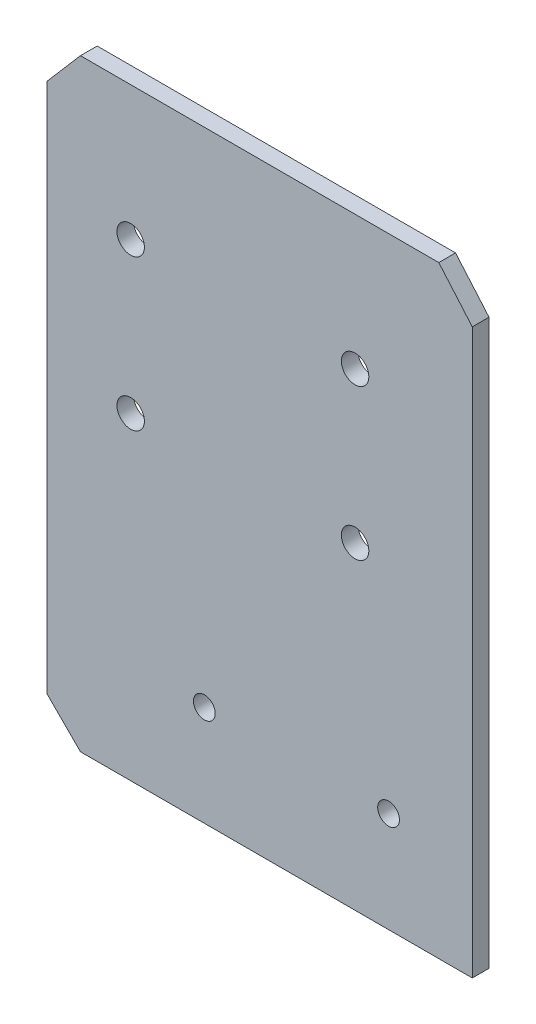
ISO-10303-21;
HEADER;
FILE_DESCRIPTION(('STEP AP214'),'2;1');
FILE_NAME('part.step','',(''),(''),'','','');
FILE_SCHEMA(('AUTOMOTIVE_DESIGN { 1 0 10303 214 1 1 1 1 }'));
ENDSEC;
DATA;
#1=APPLICATION_CONTEXT('core data for automotive mechanical design processes');
#2=APPLICATION_PROTOCOL_DEFINITION('international standard','automotive_design',2000,#1);
#3=PRODUCT_CONTEXT('',#1,'mechanical');
#4=PRODUCT('Part','Part','',(#3));
#5=PRODUCT_RELATED_PRODUCT_CATEGORY('part','',(#4));
#6=PRODUCT_DEFINITION_FORMATION('','',#4);
#7=PRODUCT_DEFINITION_CONTEXT('part definition',#1,'design');
#8=PRODUCT_DEFINITION('design','',#6,#7);
#9=PRODUCT_DEFINITION_SHAPE('','',#8);
#10=(LENGTH_UNIT() NAMED_UNIT(*) SI_UNIT(.MILLI.,.METRE.));
#11=(NAMED_UNIT(*) PLANE_ANGLE_UNIT() SI_UNIT($,.RADIAN.));
#12=(NAMED_UNIT(*) SI_UNIT($,.STERADIAN.) SOLID_ANGLE_UNIT());
#13=UNCERTAINTY_MEASURE_WITH_UNIT(LENGTH_MEASURE(1.E-05),#10,'distance_accuracy_value','');
#14=(GEOMETRIC_REPRESENTATION_CONTEXT(3) GLOBAL_UNCERTAINTY_ASSIGNED_CONTEXT((#13)) GLOBAL_UNIT_ASSIGNED_CONTEXT((#10,
#11,#12)) REPRESENTATION_CONTEXT('',''));
#15=CARTESIAN_POINT('',(0.,0.,0.));
#16=DIRECTION('',(0.,0.,1.));
#17=DIRECTION('',(1.,0.,0.));
#18=AXIS2_PLACEMENT_3D('',#15,#16,#17);
#19=CARTESIAN_POINT('',(-146.2542,-84.7491229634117,5.));
#20=DIRECTION('',(-1.,0.,0.));
#21=DIRECTION('',(0.,0.,1.));
#22=AXIS2_PLACEMENT_3D('',#19,#20,#21);
#23=PLANE('',#22);
#24=DIRECTION('',(0.,1.,0.));
#25=VECTOR('',#24,1.);
#26=CARTESIAN_POINT('',(-146.2542,-84.7491229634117,0.));
#27=LINE('',#26,#25);
#28=CARTESIAN_POINT('',(-146.2542,6.74002962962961,0.));
#29=VERTEX_POINT('',#28);
#30=CARTESIAN_POINT('',(-146.2542,165.11502962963,0.));
#31=VERTEX_POINT('',#30);
#32=EDGE_CURVE('E137',#29,#31,#27,.T.);
#33=ORIENTED_EDGE('',*,*,#32,.F.);
#34=DIRECTION('',(0.,0.,-1.));
#35=VECTOR('',#34,1.);
#36=CARTESIAN_POINT('',(-146.2542,6.74002962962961,5.));
#37=LINE('',#36,#35);
#38=CARTESIAN_POINT('',(-146.2542,6.74002962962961,5.));
#39=VERTEX_POINT('',#38);
#40=EDGE_CURVE('E11',#39,#29,#37,.T.);
#41=ORIENTED_EDGE('',*,*,#40,.F.);
#42=DIRECTION('',(0.,1.,0.));
#43=VECTOR('',#42,1.);
#44=CARTESIAN_POINT('',(-146.2542,-84.7491229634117,5.));
#45=LINE('',#44,#43);
#46=CARTESIAN_POINT('',(-146.2542,165.11502962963,5.));
#47=VERTEX_POINT('',#46);
#48=EDGE_CURVE('E326',#39,#47,#45,.T.);
#49=ORIENTED_EDGE('',*,*,#48,.T.);
#50=DIRECTION('',(0.,0.,-1.));
#51=VECTOR('',#50,1.);
#52=CARTESIAN_POINT('',(-146.2542,165.11502962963,5.));
#53=LINE('',#52,#51);
#54=EDGE_CURVE('E79',#47,#31,#53,.T.);
#55=ORIENTED_EDGE('',*,*,#54,.T.);
#56=EDGE_LOOP('',(#33,#41,#49,#55));
#57=FACE_BOUND('',#56,.T.);
#58=ADVANCED_FACE('F31',(#57),#23,.T.);
#59=CARTESIAN_POINT('',(-68.7596237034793,-70.754546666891,5.));
#60=DIRECTION('',(-0.707106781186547,-0.707106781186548,0.));
#61=DIRECTION('',(0.707106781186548,-0.707106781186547,0.));
#62=AXIS2_PLACEMENT_3D('',#59,#60,#61);
#63=PLANE('',#62);
#64=DIRECTION('',(-0.707106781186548,0.707106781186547,0.));
#65=VECTOR('',#64,1.);
#66=CARTESIAN_POINT('',(-68.7596237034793,-70.754546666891,0.));
#67=LINE('',#66,#65);
#68=CARTESIAN_POINT('',(-136.2542,-3.25997037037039,0.));
#69=VERTEX_POINT('',#68);
#70=EDGE_CURVE('E135',#69,#29,#67,.T.);
#71=ORIENTED_EDGE('',*,*,#70,.F.);
#72=DIRECTION('',(0.,0.,-1.));
#73=VECTOR('',#72,1.);
#74=CARTESIAN_POINT('',(-136.2542,-3.25997037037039,5.));
#75=LINE('',#74,#73);
#76=CARTESIAN_POINT('',(-136.2542,-3.25997037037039,5.));
#77=VERTEX_POINT('',#76);
#78=EDGE_CURVE('E40',#77,#69,#75,.T.);
#79=ORIENTED_EDGE('',*,*,#78,.F.);
#80=DIRECTION('',(-0.707106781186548,0.707106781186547,0.));
#81=VECTOR('',#80,1.);
#82=CARTESIAN_POINT('',(-68.7596237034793,-70.754546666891,5.));
#83=LINE('',#82,#81);
#84=EDGE_CURVE('E324',#77,#39,#83,.T.);
#85=ORIENTED_EDGE('',*,*,#84,.T.);
#86=ORIENTED_EDGE('',*,*,#40,.T.);
#87=EDGE_LOOP('',(#71,#79,#85,#86));
#88=FACE_BOUND('',#87,.T.);
#89=ADVANCED_FACE('F136',(#88),#63,.T.);
#90=CARTESIAN_POINT('',(-82.7542,-3.25997037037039,5.));
#91=DIRECTION('',(0.,-1.,0.));
#92=DIRECTION('',(1.,0.,0.));
#93=AXIS2_PLACEMENT_3D('',#90,#91,#92);
#94=PLANE('',#93);
#95=DIRECTION('',(-1.,0.,0.));
#96=VECTOR('',#95,1.);
#97=CARTESIAN_POINT('',(-82.7542,-3.25997037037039,0.));
#98=LINE('',#97,#96);
#99=CARTESIAN_POINT('',(-19.2542,-3.25997037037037,0.));
#100=VERTEX_POINT('',#99);
#101=EDGE_CURVE('E129',#100,#69,#98,.T.);
#102=ORIENTED_EDGE('',*,*,#101,.F.);
#103=DIRECTION('',(0.,0.,-1.));
#104=VECTOR('',#103,1.);
#105=CARTESIAN_POINT('',(-19.2542,-3.25997037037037,5.));
#106=LINE('',#105,#104);
#107=CARTESIAN_POINT('',(-19.2542,-3.25997037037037,5.));
#108=VERTEX_POINT('',#107);
#109=EDGE_CURVE('E118',#108,#100,#106,.T.);
#110=ORIENTED_EDGE('',*,*,#109,.F.);
#111=DIRECTION('',(-1.,0.,0.));
#112=VECTOR('',#111,1.);
#113=CARTESIAN_POINT('',(-82.7542,-3.25997037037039,5.));
#114=LINE('',#113,#112);
#115=EDGE_CURVE('E130',#108,#77,#114,.T.);
#116=ORIENTED_EDGE('',*,*,#115,.T.);
#117=ORIENTED_EDGE('',*,*,#78,.T.);
#118=EDGE_LOOP('',(#102,#110,#116,#117));
#119=FACE_BOUND('',#118,.T.);
#120=ADVANCED_FACE('F127',(#119),#94,.T.);
#121=CARTESIAN_POINT('',(-19.2542,-84.7491229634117,5.));
#122=DIRECTION('',(-1.,0.,0.));
#123=DIRECTION('',(0.,0.,1.));
#124=AXIS2_PLACEMENT_3D('',#121,#122,#123);
#125=PLANE('',#124);
#126=DIRECTION('',(0.,1.,0.));
#127=VECTOR('',#126,1.);
#128=CARTESIAN_POINT('',(-19.2542,-84.7491229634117,0.));
#129=LINE('',#128,#127);
#130=CARTESIAN_POINT('',(-19.2542,165.11502962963,0.));
#131=VERTEX_POINT('',#130);
#132=EDGE_CURVE('E142',#100,#131,#129,.T.);
#133=ORIENTED_EDGE('',*,*,#132,.T.);
#134=DIRECTION('',(0.,0.,-1.));
#135=VECTOR('',#134,1.);
#136=CARTESIAN_POINT('',(-19.2542,165.11502962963,5.));
#137=LINE('',#136,#135);
#138=CARTESIAN_POINT('',(-19.2542,165.11502962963,5.));
#139=VERTEX_POINT('',#138);
#140=EDGE_CURVE('E116',#139,#131,#137,.T.);
#141=ORIENTED_EDGE('',*,*,#140,.F.);
#142=DIRECTION('',(0.,1.,0.));
#143=VECTOR('',#142,1.);
#144=CARTESIAN_POINT('',(-19.2542,-84.7491229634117,5.));
#145=LINE('',#144,#143);
#146=EDGE_CURVE('E109',#108,#139,#145,.T.);
#147=ORIENTED_EDGE('',*,*,#146,.F.);
#148=ORIENTED_EDGE('',*,*,#109,.T.);
#149=EDGE_LOOP('',(#133,#141,#147,#148));
#150=FACE_BOUND('',#149,.T.);
#151=ADVANCED_FACE('F235',(#150),#125,.F.);
#152=CARTESIAN_POINT('',(77.2697747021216,52.9059090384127,5.));
#153=DIRECTION('',(-0.758104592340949,-0.652132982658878,0.));
#154=DIRECTION('',(0.652132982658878,-0.758104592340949,0.));
#155=AXIS2_PLACEMENT_3D('',#152,#153,#154);
#156=PLANE('',#155);
#157=DIRECTION('',(-0.652132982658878,0.758104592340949,0.));
#158=VECTOR('',#157,1.);
#159=CARTESIAN_POINT('',(77.2697747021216,52.9059090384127,0.));
#160=LINE('',#159,#158);
#161=CARTESIAN_POINT('',(-29.2542,176.74002962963,0.));
#162=VERTEX_POINT('',#161);
#163=EDGE_CURVE('E115',#131,#162,#160,.T.);
#164=ORIENTED_EDGE('',*,*,#163,.T.);
#165=DIRECTION('',(0.,0.,-1.));
#166=VECTOR('',#165,1.);
#167=CARTESIAN_POINT('',(-29.2542,176.74002962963,5.));
#168=LINE('',#167,#166);
#169=CARTESIAN_POINT('',(-29.2542,176.74002962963,5.));
#170=VERTEX_POINT('',#169);
#171=EDGE_CURVE('E100',#170,#162,#168,.T.);
#172=ORIENTED_EDGE('',*,*,#171,.F.);
#173=DIRECTION('',(-0.652132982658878,0.758104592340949,0.));
#174=VECTOR('',#173,1.);
#175=CARTESIAN_POINT('',(77.2697747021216,52.9059090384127,5.));
#176=LINE('',#175,#174);
#177=EDGE_CURVE('E103',#139,#170,#176,.T.);
#178=ORIENTED_EDGE('',*,*,#177,.F.);
#179=ORIENTED_EDGE('',*,*,#140,.T.);
#180=EDGE_LOOP('',(#164,#172,#178,#179));
#181=FACE_BOUND('',#180,.T.);
#182=ADVANCED_FACE('F114',(#181),#156,.F.);
#183=CARTESIAN_POINT('',(-82.7542000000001,176.74002962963,5.));
#184=DIRECTION('',(0.,-1.,0.));
#185=DIRECTION('',(1.,0.,0.));
#186=AXIS2_PLACEMENT_3D('',#183,#184,#185);
#187=PLANE('',#186);
#188=DIRECTION('',(-1.,0.,0.));
#189=VECTOR('',#188,1.);
#190=CARTESIAN_POINT('',(-82.7542000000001,176.74002962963,0.));
#191=LINE('',#190,#189);
#192=CARTESIAN_POINT('',(-136.2542,176.74002962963,0.));
#193=VERTEX_POINT('',#192);
#194=EDGE_CURVE('E148',#162,#193,#191,.T.);
#195=ORIENTED_EDGE('',*,*,#194,.T.);
#196=DIRECTION('',(0.,0.,-1.));
#197=VECTOR('',#196,1.);
#198=CARTESIAN_POINT('',(-136.2542,176.74002962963,5.));
#199=LINE('',#198,#197);
#200=CARTESIAN_POINT('',(-136.2542,176.74002962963,5.));
#201=VERTEX_POINT('',#200);
#202=EDGE_CURVE('E102',#201,#193,#199,.T.);
#203=ORIENTED_EDGE('',*,*,#202,.F.);
#204=DIRECTION('',(-1.,0.,0.));
#205=VECTOR('',#204,1.);
#206=CARTESIAN_POINT('',(-82.7542000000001,176.74002962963,5.));
#207=LINE('',#206,#205);
#208=EDGE_CURVE('E95',#170,#201,#207,.T.);
#209=ORIENTED_EDGE('',*,*,#208,.F.);
#210=ORIENTED_EDGE('',*,*,#171,.T.);
#211=EDGE_LOOP('',(#195,#203,#209,#210));
#212=FACE_BOUND('',#211,.T.);
#213=ADVANCED_FACE('F98',(#212),#187,.F.);
#214=CARTESIAN_POINT('',(-121.2542,136.74002962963,5.));
#215=DIRECTION('',(0.,0.,-1.));
#216=DIRECTION('',(-1.,0.,0.));
#217=AXIS2_PLACEMENT_3D('',#214,#215,#216);
#218=CYLINDRICAL_SURFACE('',#217,4.09999999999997);
#219=CARTESIAN_POINT('',(-121.2542,136.74002962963,5.));
#220=DIRECTION('',(0.,0.,1.));
#221=DIRECTION('',(1.,0.,0.));
#222=AXIS2_PLACEMENT_3D('',#219,#220,#221);
#223=CIRCLE('',#222,4.09999999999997);
#224=CARTESIAN_POINT('',(-117.1542,136.74002962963,5.));
#225=VERTEX_POINT('',#224);
#226=EDGE_CURVE('E330',#225,#225,#223,.T.);
#227=ORIENTED_EDGE('',*,*,#226,.T.);
#228=EDGE_LOOP('',(#227));
#229=FACE_BOUND('',#228,.T.);
#230=CARTESIAN_POINT('',(-121.2542,136.74002962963,0.));
#231=DIRECTION('',(0.,0.,1.));
#232=DIRECTION('',(1.,0.,0.));
#233=AXIS2_PLACEMENT_3D('',#230,#231,#232);
#234=CIRCLE('',#233,4.09999999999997);
#235=CARTESIAN_POINT('',(-117.1542,136.74002962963,0.));
#236=VERTEX_POINT('',#235);
#237=EDGE_CURVE('E168',#236,#236,#234,.T.);
#238=ORIENTED_EDGE('',*,*,#237,.F.);
#239=EDGE_LOOP('',(#238));
#240=FACE_BOUND('',#239,.T.);
#241=ADVANCED_FACE('F178',(#229,#240),#218,.F.);
#242=CARTESIAN_POINT('',(-54.2542,136.74002962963,5.));
#243=DIRECTION('',(0.,0.,-1.));
#244=DIRECTION('',(-1.,0.,0.));
#245=AXIS2_PLACEMENT_3D('',#242,#243,#244);
#246=CYLINDRICAL_SURFACE('',#245,4.1);
#247=CARTESIAN_POINT('',(-54.2542,136.74002962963,5.));
#248=DIRECTION('',(0.,0.,1.));
#249=DIRECTION('',(1.,0.,0.));
#250=AXIS2_PLACEMENT_3D('',#247,#248,#249);
#251=CIRCLE('',#250,4.1);
#252=CARTESIAN_POINT('',(-50.1542,136.74002962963,5.));
#253=VERTEX_POINT('',#252);
#254=EDGE_CURVE('E333',#253,#253,#251,.T.);
#255=ORIENTED_EDGE('',*,*,#254,.T.);
#256=EDGE_LOOP('',(#255));
#257=FACE_BOUND('',#256,.T.);
#258=CARTESIAN_POINT('',(-54.2542,136.74002962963,0.));
#259=DIRECTION('',(0.,0.,1.));
#260=DIRECTION('',(1.,0.,0.));
#261=AXIS2_PLACEMENT_3D('',#258,#259,#260);
#262=CIRCLE('',#261,4.1);
#263=CARTESIAN_POINT('',(-50.1542,136.74002962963,0.));
#264=VERTEX_POINT('',#263);
#265=EDGE_CURVE('E165',#264,#264,#262,.T.);
#266=ORIENTED_EDGE('',*,*,#265,.F.);
#267=EDGE_LOOP('',(#266));
#268=FACE_BOUND('',#267,.T.);
#269=ADVANCED_FACE('F181',(#257,#268),#246,.F.);
#270=CARTESIAN_POINT('',(-54.2542,91.7400296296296,5.));
#271=DIRECTION('',(0.,0.,-1.));
#272=DIRECTION('',(-1.,0.,0.));
#273=AXIS2_PLACEMENT_3D('',#270,#271,#272);
#274=CYLINDRICAL_SURFACE('',#273,4.1);
#275=CARTESIAN_POINT('',(-54.2542,91.7400296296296,5.));
#276=DIRECTION('',(0.,0.,1.));
#277=DIRECTION('',(1.,0.,0.));
#278=AXIS2_PLACEMENT_3D('',#275,#276,#277);
#279=CIRCLE('',#278,4.1);
#280=CARTESIAN_POINT('',(-50.1542,91.7400296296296,5.));
#281=VERTEX_POINT('',#280);
#282=EDGE_CURVE('E336',#281,#281,#279,.T.);
#283=ORIENTED_EDGE('',*,*,#282,.T.);
#284=EDGE_LOOP('',(#283));
#285=FACE_BOUND('',#284,.T.);
#286=CARTESIAN_POINT('',(-54.2542,91.7400296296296,0.));
#287=DIRECTION('',(0.,0.,1.));
#288=DIRECTION('',(1.,0.,0.));
#289=AXIS2_PLACEMENT_3D('',#286,#287,#288);
#290=CIRCLE('',#289,4.1);
#291=CARTESIAN_POINT('',(-50.1542,91.7400296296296,0.));
#292=VERTEX_POINT('',#291);
#293=EDGE_CURVE('E162',#292,#292,#290,.T.);
#294=ORIENTED_EDGE('',*,*,#293,.F.);
#295=EDGE_LOOP('',(#294));
#296=FACE_BOUND('',#295,.T.);
#297=ADVANCED_FACE('F185',(#285,#296),#274,.F.);
#298=CARTESIAN_POINT('',(-121.2542,91.7400296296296,5.));
#299=DIRECTION('',(0.,0.,-1.));
#300=DIRECTION('',(-1.,0.,0.));
#301=AXIS2_PLACEMENT_3D('',#298,#299,#300);
#302=CYLINDRICAL_SURFACE('',#301,4.09999999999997);
#303=CARTESIAN_POINT('',(-121.2542,91.7400296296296,5.));
#304=DIRECTION('',(0.,0.,1.));
#305=DIRECTION('',(1.,0.,0.));
#306=AXIS2_PLACEMENT_3D('',#303,#304,#305);
#307=CIRCLE('',#306,4.09999999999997);
#308=CARTESIAN_POINT('',(-117.1542,91.7400296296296,5.));
#309=VERTEX_POINT('',#308);
#310=EDGE_CURVE('E339',#309,#309,#307,.T.);
#311=ORIENTED_EDGE('',*,*,#310,.T.);
#312=EDGE_LOOP('',(#311));
#313=FACE_BOUND('',#312,.T.);
#314=CARTESIAN_POINT('',(-121.2542,91.7400296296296,0.));
#315=DIRECTION('',(0.,0.,1.));
#316=DIRECTION('',(1.,0.,0.));
#317=AXIS2_PLACEMENT_3D('',#314,#315,#316);
#318=CIRCLE('',#317,4.09999999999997);
#319=CARTESIAN_POINT('',(-117.1542,91.7400296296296,0.));
#320=VERTEX_POINT('',#319);
#321=EDGE_CURVE('E159',#320,#320,#318,.T.);
#322=ORIENTED_EDGE('',*,*,#321,.F.);
#323=EDGE_LOOP('',(#322));
#324=FACE_BOUND('',#323,.T.);
#325=ADVANCED_FACE('F189',(#313,#324),#302,.F.);
#326=CARTESIAN_POINT('',(-99.2542,26.7400296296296,5.));
#327=DIRECTION('',(0.,0.,-1.));
#328=DIRECTION('',(-1.,0.,0.));
#329=AXIS2_PLACEMENT_3D('',#326,#327,#328);
#330=CYLINDRICAL_SURFACE('',#329,3.25000000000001);
#331=CARTESIAN_POINT('',(-99.2542,26.7400296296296,5.));
#332=DIRECTION('',(0.,0.,1.));
#333=DIRECTION('',(1.,0.,0.));
#334=AXIS2_PLACEMENT_3D('',#331,#332,#333);
#335=CIRCLE('',#334,3.25000000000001);
#336=CARTESIAN_POINT('',(-96.0042,26.7400296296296,5.));
#337=VERTEX_POINT('',#336);
#338=EDGE_CURVE('E204',#337,#337,#335,.T.);
#339=ORIENTED_EDGE('',*,*,#338,.T.);
#340=EDGE_LOOP('',(#339));
#341=FACE_BOUND('',#340,.T.);
#342=CARTESIAN_POINT('',(-99.2542,26.7400296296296,0.));
#343=DIRECTION('',(0.,0.,1.));
#344=DIRECTION('',(1.,0.,0.));
#345=AXIS2_PLACEMENT_3D('',#342,#343,#344);
#346=CIRCLE('',#345,3.25000000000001);
#347=CARTESIAN_POINT('',(-96.0042,26.7400296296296,0.));
#348=VERTEX_POINT('',#347);
#349=EDGE_CURVE('E156',#348,#348,#346,.T.);
#350=ORIENTED_EDGE('',*,*,#349,.F.);
#351=EDGE_LOOP('',(#350));
#352=FACE_BOUND('',#351,.T.);
#353=ADVANCED_FACE('F192',(#341,#352),#330,.F.);
#354=CARTESIAN_POINT('',(-44.2542,26.7400296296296,5.));
#355=DIRECTION('',(0.,0.,-1.));
#356=DIRECTION('',(-1.,0.,0.));
#357=AXIS2_PLACEMENT_3D('',#354,#355,#356);
#358=CYLINDRICAL_SURFACE('',#357,3.25);
#359=CARTESIAN_POINT('',(-44.2542,26.7400296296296,5.));
#360=DIRECTION('',(0.,0.,1.));
#361=DIRECTION('',(1.,0.,0.));
#362=AXIS2_PLACEMENT_3D('',#359,#360,#361);
#363=CIRCLE('',#362,3.25);
#364=CARTESIAN_POINT('',(-41.0042,26.7400296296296,5.));
#365=VERTEX_POINT('',#364);
#366=EDGE_CURVE('E150',#365,#365,#363,.T.);
#367=ORIENTED_EDGE('',*,*,#366,.T.);
#368=EDGE_LOOP('',(#367));
#369=FACE_BOUND('',#368,.T.);
#370=CARTESIAN_POINT('',(-44.2542,26.7400296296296,0.));
#371=DIRECTION('',(0.,0.,1.));
#372=DIRECTION('',(1.,0.,0.));
#373=AXIS2_PLACEMENT_3D('',#370,#371,#372);
#374=CIRCLE('',#373,3.25);
#375=CARTESIAN_POINT('',(-41.0042,26.7400296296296,0.));
#376=VERTEX_POINT('',#375);
#377=EDGE_CURVE('E153',#376,#376,#374,.T.);
#378=ORIENTED_EDGE('',*,*,#377,.F.);
#379=EDGE_LOOP('',(#378));
#380=FACE_BOUND('',#379,.T.);
#381=ADVANCED_FACE('F33',(#369,#380),#358,.F.);
#382=CARTESIAN_POINT('',(-242.778174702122,52.9059090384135,5.));
#383=DIRECTION('',(0.758104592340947,-0.65213298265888,0.));
#384=DIRECTION('',(0.65213298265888,0.758104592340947,0.));
#385=AXIS2_PLACEMENT_3D('',#382,#383,#384);
#386=PLANE('',#385);
#387=DIRECTION('',(-0.65213298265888,-0.758104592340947,0.));
#388=VECTOR('',#387,1.);
#389=CARTESIAN_POINT('',(-242.778174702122,52.9059090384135,0.));
#390=LINE('',#389,#388);
#391=EDGE_CURVE('E72',#193,#31,#390,.T.);
#392=ORIENTED_EDGE('',*,*,#391,.T.);
#393=ORIENTED_EDGE('',*,*,#54,.F.);
#394=DIRECTION('',(-0.65213298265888,-0.758104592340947,0.));
#395=VECTOR('',#394,1.);
#396=CARTESIAN_POINT('',(-242.778174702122,52.9059090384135,5.));
#397=LINE('',#396,#395);
#398=EDGE_CURVE('E48',#201,#47,#397,.T.);
#399=ORIENTED_EDGE('',*,*,#398,.F.);
#400=ORIENTED_EDGE('',*,*,#202,.T.);
#401=EDGE_LOOP('',(#392,#393,#399,#400));
#402=FACE_BOUND('',#401,.T.);
#403=ADVANCED_FACE('F199',(#402),#386,.F.);
#404=CARTESIAN_POINT('',(-82.7542,-84.7491229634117,5.));
#405=DIRECTION('',(0.,0.,1.));
#406=DIRECTION('',(1.,0.,0.));
#407=AXIS2_PLACEMENT_3D('',#404,#405,#406);
#408=PLANE('',#407);
#409=ORIENTED_EDGE('',*,*,#366,.F.);
#410=EDGE_LOOP('',(#409));
#411=FACE_BOUND('',#410,.T.);
#412=ORIENTED_EDGE('',*,*,#338,.F.);
#413=EDGE_LOOP('',(#412));
#414=FACE_BOUND('',#413,.T.);
#415=ORIENTED_EDGE('',*,*,#310,.F.);
#416=EDGE_LOOP('',(#415));
#417=FACE_BOUND('',#416,.T.);
#418=ORIENTED_EDGE('',*,*,#282,.F.);
#419=EDGE_LOOP('',(#418));
#420=FACE_BOUND('',#419,.T.);
#421=ORIENTED_EDGE('',*,*,#254,.F.);
#422=EDGE_LOOP('',(#421));
#423=FACE_BOUND('',#422,.T.);
#424=ORIENTED_EDGE('',*,*,#226,.F.);
#425=EDGE_LOOP('',(#424));
#426=FACE_BOUND('',#425,.T.);
#427=ORIENTED_EDGE('',*,*,#48,.F.);
#428=ORIENTED_EDGE('',*,*,#84,.F.);
#429=ORIENTED_EDGE('',*,*,#115,.F.);
#430=ORIENTED_EDGE('',*,*,#146,.T.);
#431=ORIENTED_EDGE('',*,*,#177,.T.);
#432=ORIENTED_EDGE('',*,*,#208,.T.);
#433=ORIENTED_EDGE('',*,*,#398,.T.);
#434=EDGE_LOOP('',(#427,#428,#429,#430,#431,#432,#433));
#435=FACE_BOUND('',#434,.T.);
#436=ADVANCED_FACE('F106',(#411,#414,#417,#420,#423,#426,#435),#408,.T.);
#437=CARTESIAN_POINT('',(-82.7542,-84.7491229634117,0.));
#438=DIRECTION('',(0.,0.,1.));
#439=DIRECTION('',(1.,0.,0.));
#440=AXIS2_PLACEMENT_3D('',#437,#438,#439);
#441=PLANE('',#440);
#442=ORIENTED_EDGE('',*,*,#377,.T.);
#443=EDGE_LOOP('',(#442));
#444=FACE_BOUND('',#443,.T.);
#445=ORIENTED_EDGE('',*,*,#349,.T.);
#446=EDGE_LOOP('',(#445));
#447=FACE_BOUND('',#446,.T.);
#448=ORIENTED_EDGE('',*,*,#321,.T.);
#449=EDGE_LOOP('',(#448));
#450=FACE_BOUND('',#449,.T.);
#451=ORIENTED_EDGE('',*,*,#293,.T.);
#452=EDGE_LOOP('',(#451));
#453=FACE_BOUND('',#452,.T.);
#454=ORIENTED_EDGE('',*,*,#265,.T.);
#455=EDGE_LOOP('',(#454));
#456=FACE_BOUND('',#455,.T.);
#457=ORIENTED_EDGE('',*,*,#237,.T.);
#458=EDGE_LOOP('',(#457));
#459=FACE_BOUND('',#458,.T.);
#460=ORIENTED_EDGE('',*,*,#32,.T.);
#461=ORIENTED_EDGE('',*,*,#391,.F.);
#462=ORIENTED_EDGE('',*,*,#194,.F.);
#463=ORIENTED_EDGE('',*,*,#163,.F.);
#464=ORIENTED_EDGE('',*,*,#132,.F.);
#465=ORIENTED_EDGE('',*,*,#101,.T.);
#466=ORIENTED_EDGE('',*,*,#70,.T.);
#467=EDGE_LOOP('',(#460,#461,#462,#463,#464,#465,#466));
#468=FACE_BOUND('',#467,.T.);
#469=ADVANCED_FACE('F140',(#444,#447,#450,#453,#456,#459,#468),#441,.F.);
#470=CLOSED_SHELL('',(#58,#89,#120,#151,#182,#213,#241,#269,#297,#325,#353,#381,#403,#436,#469));
#471=MANIFOLD_SOLID_BREP('B2',#470);
#472=ADVANCED_BREP_SHAPE_REPRESENTATION('',(#18,#471),#14);
#473=SHAPE_DEFINITION_REPRESENTATION(#9,#472);
ENDSEC;
END-ISO-10303-21;
